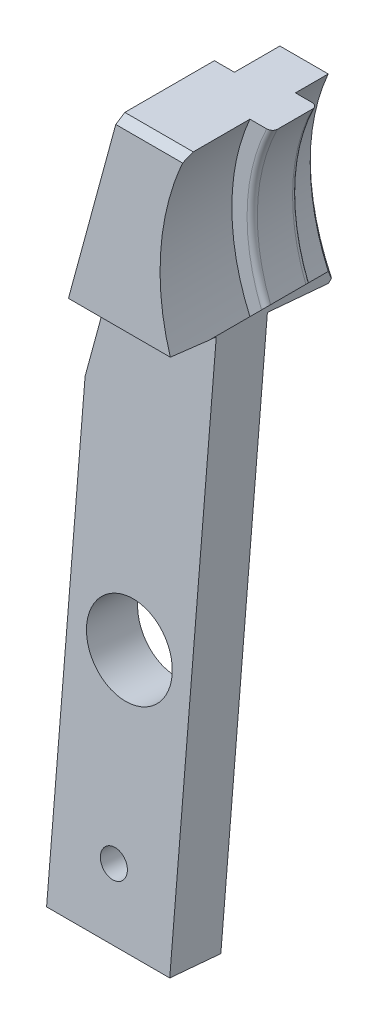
ISO-10303-21;
HEADER;
FILE_DESCRIPTION(('STEP AP214'),'2;1');
FILE_NAME('part.step','',(''),(''),'','','');
FILE_SCHEMA(('AUTOMOTIVE_DESIGN { 1 0 10303 214 1 1 1 1 }'));
ENDSEC;
DATA;
#1=APPLICATION_CONTEXT('core data for automotive mechanical design processes');
#2=APPLICATION_PROTOCOL_DEFINITION('international standard','automotive_design',2000,#1);
#3=PRODUCT_CONTEXT('',#1,'mechanical');
#4=PRODUCT('Part','Part','',(#3));
#5=PRODUCT_RELATED_PRODUCT_CATEGORY('part','',(#4));
#6=PRODUCT_DEFINITION_FORMATION('','',#4);
#7=PRODUCT_DEFINITION_CONTEXT('part definition',#1,'design');
#8=PRODUCT_DEFINITION('design','',#6,#7);
#9=PRODUCT_DEFINITION_SHAPE('','',#8);
#10=(LENGTH_UNIT() NAMED_UNIT(*) SI_UNIT(.MILLI.,.METRE.));
#11=(NAMED_UNIT(*) PLANE_ANGLE_UNIT() SI_UNIT($,.RADIAN.));
#12=(NAMED_UNIT(*) SI_UNIT($,.STERADIAN.) SOLID_ANGLE_UNIT());
#13=UNCERTAINTY_MEASURE_WITH_UNIT(LENGTH_MEASURE(1.E-05),#10,'distance_accuracy_value','');
#14=(GEOMETRIC_REPRESENTATION_CONTEXT(3) GLOBAL_UNCERTAINTY_ASSIGNED_CONTEXT((#13)) GLOBAL_UNIT_ASSIGNED_CONTEXT((#10,
#11,#12)) REPRESENTATION_CONTEXT('',''));
#15=CARTESIAN_POINT('',(0.,0.,0.));
#16=DIRECTION('',(0.,0.,1.));
#17=DIRECTION('',(1.,0.,0.));
#18=AXIS2_PLACEMENT_3D('',#15,#16,#17);
#19=CARTESIAN_POINT('',(-14.3693583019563,21.59,13.208));
#20=DIRECTION('',(-1.,0.,0.));
#21=DIRECTION('',(0.,1.,0.));
#22=AXIS2_PLACEMENT_3D('',#19,#20,#21);
#23=PLANE('',#22);
#24=DIRECTION('',(0.,0.0871557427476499,0.996194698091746));
#25=VECTOR('',#24,1.);
#26=CARTESIAN_POINT('',(-14.3693583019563,21.2109257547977,5.83884971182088));
#27=LINE('',#26,#25);
#28=CARTESIAN_POINT('',(-14.3693583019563,20.8136810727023,1.29832221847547));
#29=VERTEX_POINT('',#28);
#30=CARTESIAN_POINT('',(-14.3693583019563,21.2109257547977,5.83884971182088));
#31=VERTEX_POINT('',#30);
#32=EDGE_CURVE('E331',#29,#31,#27,.T.);
#33=ORIENTED_EDGE('',*,*,#32,.F.);
#34=DIRECTION('',(0.,0.707106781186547,-0.707106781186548));
#35=VECTOR('',#34,1.);
#36=CARTESIAN_POINT('',(-14.3693583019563,20.8136810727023,1.29832221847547));
#37=LINE('',#36,#35);
#38=CARTESIAN_POINT('',(-14.3693583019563,21.0270608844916,1.08494240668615));
#39=VERTEX_POINT('',#38);
#40=EDGE_CURVE('E381',#29,#39,#37,.T.);
#41=ORIENTED_EDGE('',*,*,#40,.T.);
#42=CARTESIAN_POINT('',(-14.3693583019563,21.0270608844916,1.08494240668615));
#43=CARTESIAN_POINT('',(-14.3693583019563,21.1203937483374,1.12542221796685));
#44=CARTESIAN_POINT('',(-14.3693583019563,21.2139717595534,1.16531691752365));
#45=CARTESIAN_POINT('',(-14.3693583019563,21.4016181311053,1.24393611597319));
#46=CARTESIAN_POINT('',(-14.3693583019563,21.4956864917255,1.28266061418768));
#47=CARTESIAN_POINT('',(-14.3693583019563,21.59,1.3208));
#48=B_SPLINE_CURVE_WITH_KNOTS('',3,(#42,#43,#44,#45,#46,#47),.UNSPECIFIED.,.F.,.F.,(4,2,4),(0.,
0.305181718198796,0.610363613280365),.UNSPECIFIED.);
#49=CARTESIAN_POINT('',(-14.3693583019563,21.59,1.32080000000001));
#50=VERTEX_POINT('',#49);
#51=EDGE_CURVE('E376',#39,#50,#48,.T.);
#52=ORIENTED_EDGE('',*,*,#51,.T.);
#53=DIRECTION('',(0.,0.,-1.));
#54=VECTOR('',#53,1.);
#55=CARTESIAN_POINT('',(-14.3693583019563,21.59,13.208));
#56=LINE('',#55,#54);
#57=CARTESIAN_POINT('',(-14.3693583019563,21.59,3.7592));
#58=VERTEX_POINT('',#57);
#59=EDGE_CURVE('E199',#58,#50,#56,.T.);
#60=ORIENTED_EDGE('',*,*,#59,.F.);
#61=DIRECTION('',(0.,0.,-1.));
#62=VECTOR('',#61,1.);
#63=CARTESIAN_POINT('',(-14.3693583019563,21.59,7.1374));
#64=LINE('',#63,#62);
#65=CARTESIAN_POINT('',(-14.3693583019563,21.59,7.1374));
#66=VERTEX_POINT('',#65);
#67=EDGE_CURVE('E178',#66,#58,#64,.T.);
#68=ORIENTED_EDGE('',*,*,#67,.F.);
#69=CARTESIAN_POINT('',(-14.3693583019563,21.59,10.1716881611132));
#70=VERTEX_POINT('',#69);
#71=EDGE_CURVE('E189',#70,#66,#56,.T.);
#72=ORIENTED_EDGE('',*,*,#71,.F.);
#73=DIRECTION('',(0.,0.0871557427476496,0.996194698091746));
#74=VECTOR('',#73,1.);
#75=CARTESIAN_POINT('',(-14.3693583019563,21.8324014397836,12.9423492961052));
#76=LINE('',#75,#74);
#77=CARTESIAN_POINT('',(-14.3693583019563,21.5429891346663,9.63435151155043));
#78=VERTEX_POINT('',#77);
#79=EDGE_CURVE('E322',#78,#70,#76,.T.);
#80=ORIENTED_EDGE('',*,*,#79,.F.);
#81=DIRECTION('',(0.,-0.996194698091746,0.0871557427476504));
#82=VECTOR('',#81,1.);
#83=CARTESIAN_POINT('',(-14.3693583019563,21.2793641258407,9.65741571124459));
#84=LINE('',#83,#82);
#85=CARTESIAN_POINT('',(-14.3693583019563,-17.9598028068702,13.0903979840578));
#86=VERTEX_POINT('',#85);
#87=EDGE_CURVE('E226',#78,#86,#84,.T.);
#88=ORIENTED_EDGE('',*,*,#87,.T.);
#89=DIRECTION('',(0.,0.087155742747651,0.996194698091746));
#90=VECTOR('',#89,1.);
#91=CARTESIAN_POINT('',(-14.3693583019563,-17.9598028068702,13.0903979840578));
#92=LINE('',#91,#90);
#93=CARTESIAN_POINT('',(-14.3693583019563,-18.2918661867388,9.29489618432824));
#94=VERTEX_POINT('',#93);
#95=EDGE_CURVE('E318',#94,#86,#92,.T.);
#96=ORIENTED_EDGE('',*,*,#95,.F.);
#97=DIRECTION('',(0.,0.996194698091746,-0.0871557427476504));
#98=VECTOR('',#97,1.);
#99=CARTESIAN_POINT('',(-14.3693583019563,20.9473007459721,5.86191391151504));
#100=LINE('',#99,#98);
#101=EDGE_CURVE('E232',#94,#31,#100,.T.);
#102=ORIENTED_EDGE('',*,*,#101,.T.);
#103=EDGE_LOOP('',(#33,#41,#52,#60,#68,#72,#80,#88,#96,#102));
#104=FACE_BOUND('',#103,.T.);
#105=ADVANCED_FACE('F33',(#104),#23,.F.);
#106=CARTESIAN_POINT('',(-23.5133583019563,14.732,13.208));
#107=DIRECTION('',(1.,0.,0.));
#108=DIRECTION('',(0.,-1.,0.));
#109=AXIS2_PLACEMENT_3D('',#106,#107,#108);
#110=PLANE('',#109);
#111=DIRECTION('',(0.,-0.087155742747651,-0.996194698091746));
#112=VECTOR('',#111,1.);
#113=CARTESIAN_POINT('',(-23.5133583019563,-17.9598028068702,13.0903979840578));
#114=LINE('',#113,#112);
#115=CARTESIAN_POINT('',(-23.5133583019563,-17.9598028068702,13.0903979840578));
#116=VERTEX_POINT('',#115);
#117=CARTESIAN_POINT('',(-23.5133583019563,-18.2918661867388,9.29489618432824));
#118=VERTEX_POINT('',#117);
#119=EDGE_CURVE('E304',#116,#118,#114,.T.);
#120=ORIENTED_EDGE('',*,*,#119,.F.);
#121=DIRECTION('',(0.,0.996194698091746,-0.0871557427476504));
#122=VECTOR('',#121,1.);
#123=CARTESIAN_POINT('',(-23.5133583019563,14.4734583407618,10.2528553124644));
#124=LINE('',#123,#122);
#125=CARTESIAN_POINT('',(-23.5133583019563,14.732,10.2302358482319));
#126=VERTEX_POINT('',#125);
#127=EDGE_CURVE('E224',#116,#126,#124,.T.);
#128=ORIENTED_EDGE('',*,*,#127,.T.);
#129=DIRECTION('',(0.,0.,-1.));
#130=VECTOR('',#129,1.);
#131=CARTESIAN_POINT('',(-23.5133583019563,14.732,13.208));
#132=LINE('',#131,#130);
#133=CARTESIAN_POINT('',(-23.5133583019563,14.732,6.40568226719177));
#134=VERTEX_POINT('',#133);
#135=EDGE_CURVE('E240',#126,#134,#132,.T.);
#136=ORIENTED_EDGE('',*,*,#135,.T.);
#137=DIRECTION('',(0.,-0.996194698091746,0.0871557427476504));
#138=VECTOR('',#137,1.);
#139=CARTESIAN_POINT('',(-23.5133583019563,14.1413949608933,6.45735351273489));
#140=LINE('',#139,#138);
#141=EDGE_CURVE('E229',#134,#118,#140,.T.);
#142=ORIENTED_EDGE('',*,*,#141,.T.);
#143=EDGE_LOOP('',(#120,#128,#136,#142));
#144=FACE_BOUND('',#143,.T.);
#145=ADVANCED_FACE('F386',(#144),#110,.F.);
#146=CARTESIAN_POINT('',(-29.464,18.5065876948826,9.90000221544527));
#147=DIRECTION('',(0.,0.0871557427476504,0.996194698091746));
#148=DIRECTION('',(0.,-0.996194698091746,0.0871557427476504));
#149=AXIS2_PLACEMENT_3D('',#146,#147,#148);
#150=PLANE('',#149);
#151=CARTESIAN_POINT('',(-18.9413583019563,-13.1016798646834,12.6653673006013));
#152=DIRECTION('',(0.,0.0871557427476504,0.996194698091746));
#153=DIRECTION('',(0.,-0.996194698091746,0.0871557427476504));
#154=AXIS2_PLACEMENT_3D('',#151,#152,#153);
#155=CIRCLE('',#154,1.);
#156=CARTESIAN_POINT('',(-18.9413583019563,-14.0978745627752,12.7525230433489));
#157=VERTEX_POINT('',#156);
#158=EDGE_CURVE('E471',#157,#157,#155,.T.);
#159=ORIENTED_EDGE('',*,*,#158,.F.);
#160=EDGE_LOOP('',(#159));
#161=FACE_BOUND('',#160,.T.);
#162=CARTESIAN_POINT('',(-18.9413583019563,0.0560597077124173,11.5142142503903));
#163=DIRECTION('',(0.,0.0871557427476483,0.996194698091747));
#164=DIRECTION('',(0.,-0.996194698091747,0.0871557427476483));
#165=AXIS2_PLACEMENT_3D('',#162,#163,#164);
#166=CIRCLE('',#165,3.175);
#167=CARTESIAN_POINT('',(-18.9413583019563,-3.10685845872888,11.7909337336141));
#168=VERTEX_POINT('',#167);
#169=EDGE_CURVE('E306',#168,#168,#166,.T.);
#170=ORIENTED_EDGE('',*,*,#169,.F.);
#171=EDGE_LOOP('',(#170));
#172=FACE_BOUND('',#171,.T.);
#173=ORIENTED_EDGE('',*,*,#127,.F.);
#174=DIRECTION('',(-1.,0.,0.));
#175=VECTOR('',#174,1.);
#176=CARTESIAN_POINT('',(-23.5133583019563,-17.9598028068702,13.0903979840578));
#177=LINE('',#176,#175);
#178=EDGE_CURVE('E320',#86,#116,#177,.T.);
#179=ORIENTED_EDGE('',*,*,#178,.F.);
#180=ORIENTED_EDGE('',*,*,#87,.F.);
#181=DIRECTION('',(1.,0.,0.));
#182=VECTOR('',#181,1.);
#183=CARTESIAN_POINT('',(-23.5133583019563,21.5429891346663,9.63435151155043));
#184=LINE('',#183,#182);
#185=CARTESIAN_POINT('',(-22.0980878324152,21.5429891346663,9.63435151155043));
#186=VERTEX_POINT('',#185);
#187=EDGE_CURVE('E324',#186,#78,#184,.T.);
#188=ORIENTED_EDGE('',*,*,#187,.F.);
#189=DIRECTION('',(0.202704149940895,0.975513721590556,-0.0853463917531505));
#190=VECTOR('',#189,1.);
#191=CARTESIAN_POINT('',(-19.5304760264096,33.8996209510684,8.55328630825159));
#192=LINE('',#191,#190);
#193=EDGE_CURVE('E222',#126,#186,#192,.T.);
#194=ORIENTED_EDGE('',*,*,#193,.F.);
#195=EDGE_LOOP('',(#173,#179,#180,#188,#194));
#196=FACE_BOUND('',#195,.T.);
#197=ADVANCED_FACE('F388',(#161,#172,#196),#150,.T.);
#198=CARTESIAN_POINT('',(-29.464,18.1745243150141,6.10450041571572));
#199=DIRECTION('',(0.,-0.0871557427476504,-0.996194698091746));
#200=DIRECTION('',(0.,0.996194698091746,-0.0871557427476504));
#201=AXIS2_PLACEMENT_3D('',#198,#199,#200);
#202=PLANE('',#201);
#203=CARTESIAN_POINT('',(-18.9413583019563,-13.433743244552,8.86986550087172));
#204=DIRECTION('',(0.,-0.0871557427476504,-0.996194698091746));
#205=DIRECTION('',(0.,0.996194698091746,-0.0871557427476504));
#206=AXIS2_PLACEMENT_3D('',#203,#204,#205);
#207=CIRCLE('',#206,0.999999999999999);
#208=CARTESIAN_POINT('',(-18.9413583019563,-12.4375485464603,8.78270975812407));
#209=VERTEX_POINT('',#208);
#210=EDGE_CURVE('E38',#209,#209,#207,.T.);
#211=ORIENTED_EDGE('',*,*,#210,.F.);
#212=EDGE_LOOP('',(#211));
#213=FACE_BOUND('',#212,.T.);
#214=CARTESIAN_POINT('',(-18.9413583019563,-0.276003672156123,7.71871245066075));
#215=DIRECTION('',(0.,-0.0871557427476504,-0.996194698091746));
#216=DIRECTION('',(0.,0.996194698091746,-0.0871557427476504));
#217=AXIS2_PLACEMENT_3D('',#214,#215,#216);
#218=CIRCLE('',#217,3.175);
#219=CARTESIAN_POINT('',(-18.9413583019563,2.88691449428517,7.44199296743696));
#220=VERTEX_POINT('',#219);
#221=EDGE_CURVE('E298',#220,#220,#218,.T.);
#222=ORIENTED_EDGE('',*,*,#221,.F.);
#223=EDGE_LOOP('',(#222));
#224=FACE_BOUND('',#223,.T.);
#225=ORIENTED_EDGE('',*,*,#101,.F.);
#226=DIRECTION('',(1.,0.,0.));
#227=VECTOR('',#226,1.);
#228=CARTESIAN_POINT('',(-23.5133583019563,-18.2918661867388,9.29489618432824));
#229=LINE('',#228,#227);
#230=EDGE_CURVE('E316',#118,#94,#229,.T.);
#231=ORIENTED_EDGE('',*,*,#230,.F.);
#232=ORIENTED_EDGE('',*,*,#141,.F.);
#233=DIRECTION('',(-0.202704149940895,-0.975513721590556,0.0853463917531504));
#234=VECTOR('',#233,1.);
#235=CARTESIAN_POINT('',(-19.5966410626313,33.5812017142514,4.75659080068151));
#236=LINE('',#235,#234);
#237=CARTESIAN_POINT('',(-19.4493583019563,34.29,4.6945789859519));
#238=VERTEX_POINT('',#237);
#239=EDGE_CURVE('E243',#238,#134,#236,.T.);
#240=ORIENTED_EDGE('',*,*,#239,.F.);
#241=DIRECTION('',(-1.,0.,0.));
#242=VECTOR('',#241,1.);
#243=CARTESIAN_POINT('',(-14.3693583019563,34.29,4.6945789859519));
#244=LINE('',#243,#242);
#245=CARTESIAN_POINT('',(-17.9605122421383,34.29,4.6945789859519));
#246=VERTEX_POINT('',#245);
#247=EDGE_CURVE('E342',#246,#238,#244,.T.);
#248=ORIENTED_EDGE('',*,*,#247,.F.);
#249=CARTESIAN_POINT('',(0.,27.94,5.25013199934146));
#250=DIRECTION('',(0.,0.0871557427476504,0.996194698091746));
#251=DIRECTION('',(0.,0.996194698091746,-0.0871557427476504));
#252=AXIS2_PLACEMENT_3D('',#249,#250,#251);
#253=ELLIPSE('',#252,19.1227679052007,19.05);
#254=CARTESIAN_POINT('',(-17.821954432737,21.2109257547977,5.83884971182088));
#255=VERTEX_POINT('',#254);
#256=EDGE_CURVE('E339',#255,#246,#253,.F.);
#257=ORIENTED_EDGE('',*,*,#256,.F.);
#258=DIRECTION('',(1.,0.,0.));
#259=VECTOR('',#258,1.);
#260=CARTESIAN_POINT('',(-23.5133583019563,21.2109257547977,5.83884971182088));
#261=LINE('',#260,#259);
#262=EDGE_CURVE('E333',#255,#31,#261,.T.);
#263=ORIENTED_EDGE('',*,*,#262,.T.);
#264=EDGE_LOOP('',(#225,#231,#232,#240,#248,#257,#263));
#265=FACE_BOUND('',#264,.T.);
#266=ADVANCED_FACE('F427',(#213,#224,#265),#202,.T.);
#267=CARTESIAN_POINT('',(-14.3693583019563,34.29,13.208));
#268=DIRECTION('',(0.,-1.,0.));
#269=DIRECTION('',(0.,0.,-1.));
#270=AXIS2_PLACEMENT_3D('',#267,#268,#269);
#271=PLANE('',#270);
#272=DIRECTION('',(0.,0.,-1.));
#273=VECTOR('',#272,1.);
#274=CARTESIAN_POINT('',(-14.3693583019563,34.29,13.208));
#275=LINE('',#274,#273);
#276=CARTESIAN_POINT('',(-14.3693583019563,34.29,3.7592));
#277=VERTEX_POINT('',#276);
#278=CARTESIAN_POINT('',(-14.3693583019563,34.29,1.32080000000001));
#279=VERTEX_POINT('',#278);
#280=EDGE_CURVE('E198',#277,#279,#275,.T.);
#281=ORIENTED_EDGE('',*,*,#280,.T.);
#282=DIRECTION('',(-1.,0.,0.));
#283=VECTOR('',#282,1.);
#284=CARTESIAN_POINT('',(-17.9605122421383,34.29,1.32080000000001));
#285=LINE('',#284,#283);
#286=CARTESIAN_POINT('',(-17.9605122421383,34.29,1.3208));
#287=VERTEX_POINT('',#286);
#288=EDGE_CURVE('E43',#279,#287,#285,.T.);
#289=ORIENTED_EDGE('',*,*,#288,.T.);
#290=DIRECTION('',(0.,0.,-1.));
#291=VECTOR('',#290,1.);
#292=CARTESIAN_POINT('',(-17.9605122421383,34.29,86.2048044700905));
#293=LINE('',#292,#291);
#294=EDGE_CURVE('E344',#287,#246,#293,.F.);
#295=ORIENTED_EDGE('',*,*,#294,.T.);
#296=ORIENTED_EDGE('',*,*,#247,.T.);
#297=DIRECTION('',(0.,0.,-1.));
#298=VECTOR('',#297,1.);
#299=CARTESIAN_POINT('',(-19.4493583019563,34.29,13.208));
#300=LINE('',#299,#298);
#301=CARTESIAN_POINT('',(-19.4493583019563,34.29,11.3444506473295));
#302=VERTEX_POINT('',#301);
#303=EDGE_CURVE('E237',#302,#238,#300,.T.);
#304=ORIENTED_EDGE('',*,*,#303,.F.);
#305=DIRECTION('',(-1.,0.,0.));
#306=VECTOR('',#305,1.);
#307=CARTESIAN_POINT('',(-19.4493583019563,34.29,11.3444506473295));
#308=LINE('',#307,#306);
#309=CARTESIAN_POINT('',(-14.3693583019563,34.29,11.3444506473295));
#310=VERTEX_POINT('',#309);
#311=EDGE_CURVE('E363',#310,#302,#308,.T.);
#312=ORIENTED_EDGE('',*,*,#311,.F.);
#313=CARTESIAN_POINT('',(-14.3693583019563,34.29,7.1374));
#314=VERTEX_POINT('',#313);
#315=EDGE_CURVE('E235',#310,#314,#275,.T.);
#316=ORIENTED_EDGE('',*,*,#315,.T.);
#317=DIRECTION('',(1.,0.,0.));
#318=VECTOR('',#317,1.);
#319=CARTESIAN_POINT('',(-14.3693583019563,34.29,7.1374));
#320=LINE('',#319,#318);
#321=CARTESIAN_POINT('',(-13.1241089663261,34.29,7.1374));
#322=VERTEX_POINT('',#321);
#323=EDGE_CURVE('E203',#314,#322,#320,.T.);
#324=ORIENTED_EDGE('',*,*,#323,.T.);
#325=CARTESIAN_POINT('',(-12.6995173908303,34.29,6.7564));
#326=CARTESIAN_POINT('',(-12.6994901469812,34.29,6.77622995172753));
#327=CARTESIAN_POINT('',(-12.7012463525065,34.29,6.79604103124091));
#328=CARTESIAN_POINT('',(-12.7081077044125,34.29,6.83500273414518));
#329=CARTESIAN_POINT('',(-12.7132005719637,34.29,6.85415550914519));
#330=CARTESIAN_POINT('',(-12.7265161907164,34.29,6.89132005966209));
#331=CARTESIAN_POINT('',(-12.7347370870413,34.29,6.90933250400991));
#332=CARTESIAN_POINT('',(-12.7539652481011,34.29,6.9438083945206));
#333=CARTESIAN_POINT('',(-12.7649743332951,34.29,6.9602708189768));
#334=CARTESIAN_POINT('',(-12.7899073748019,34.29,6.99197288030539));
#335=CARTESIAN_POINT('',(-12.8039359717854,34.29,7.00712995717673));
#336=CARTESIAN_POINT('',(-12.8341284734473,34.29,7.03513393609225));
#337=CARTESIAN_POINT('',(-12.850292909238,34.29,7.04798026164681));
#338=CARTESIAN_POINT('',(-12.8860127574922,34.29,7.07235683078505));
#339=CARTESIAN_POINT('',(-12.905745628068,34.29,7.08362688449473));
#340=CARTESIAN_POINT('',(-12.9467037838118,34.29,7.10303585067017));
#341=CARTESIAN_POINT('',(-12.967930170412,34.29,7.11117242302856));
#342=CARTESIAN_POINT('',(-13.0114247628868,34.29,7.12425054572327));
#343=CARTESIAN_POINT('',(-13.0336964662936,34.29,7.12918040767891));
#344=CARTESIAN_POINT('',(-13.0786838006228,34.29,7.13575461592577));
#345=CARTESIAN_POINT('',(-13.1013986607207,34.29,7.13740422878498));
#346=CARTESIAN_POINT('',(-13.1241089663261,34.29,7.1374));
#347=B_SPLINE_CURVE_WITH_KNOTS('',3,(#325,#326,#327,#328,#329,#330,#331,#332,#333,#334,#335,
#336,#337,#338,#339,#340,#341,#342,#343,#344,#345,#346),.UNSPECIFIED.,.F.,.F.,(4,2,2,2,2,2,2,2,
2,2,4),(0.,0.0593827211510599,0.118548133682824,0.177678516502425,0.236847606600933,
0.298550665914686,0.360269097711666,0.428161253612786,0.496104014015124,0.564293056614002,
0.632372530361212),.UNSPECIFIED.);
#348=CARTESIAN_POINT('',(-12.6995173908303,34.29,6.7564));
#349=VERTEX_POINT('',#348);
#350=EDGE_CURVE('E252',#349,#322,#347,.T.);
#351=ORIENTED_EDGE('',*,*,#350,.F.);
#352=DIRECTION('',(0.,0.,-1.));
#353=VECTOR('',#352,1.);
#354=CARTESIAN_POINT('',(-12.6995173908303,34.29,7.1374));
#355=LINE('',#354,#353);
#356=CARTESIAN_POINT('',(-12.6995173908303,34.29,4.1402));
#357=VERTEX_POINT('',#356);
#358=EDGE_CURVE('E210',#349,#357,#355,.T.);
#359=ORIENTED_EDGE('',*,*,#358,.T.);
#360=CARTESIAN_POINT('',(-13.1241089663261,34.29,3.7592));
#361=CARTESIAN_POINT('',(-13.098138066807,34.29,3.75919255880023));
#362=CARTESIAN_POINT('',(-13.072158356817,34.29,3.76135190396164));
#363=CARTESIAN_POINT('',(-13.0208454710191,34.29,3.76995224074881));
#364=CARTESIAN_POINT('',(-12.9955142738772,34.29,3.77640501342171));
#365=CARTESIAN_POINT('',(-12.9462773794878,34.29,3.79355233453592));
#366=CARTESIAN_POINT('',(-12.922373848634,34.29,3.80425314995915));
#367=CARTESIAN_POINT('',(-12.8768695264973,34.29,3.82974044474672));
#368=CARTESIAN_POINT('',(-12.8552662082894,34.29,3.84452237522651));
#369=CARTESIAN_POINT('',(-12.8163667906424,34.29,3.87694868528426));
#370=CARTESIAN_POINT('',(-12.7988953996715,34.29,3.89438195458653));
#371=CARTESIAN_POINT('',(-12.7675557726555,34.29,3.9322530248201));
#372=CARTESIAN_POINT('',(-12.7536863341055,34.29,3.95268981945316));
#373=CARTESIAN_POINT('',(-12.7315803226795,34.29,3.99359045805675));
#374=CARTESIAN_POINT('',(-12.7228976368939,34.29,4.01381378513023));
#375=CARTESIAN_POINT('',(-12.7094712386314,34.29,4.05550705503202));
#376=CARTESIAN_POINT('',(-12.7047181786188,34.29,4.07697390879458));
#377=CARTESIAN_POINT('',(-12.7012103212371,34.29,4.10555694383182));
#378=CARTESIAN_POINT('',(-12.7005754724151,34.29,4.11247549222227));
#379=CARTESIAN_POINT('',(-12.6997296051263,34.29,4.12632817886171));
#380=CARTESIAN_POINT('',(-12.6995179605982,34.29,4.13326227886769));
#381=CARTESIAN_POINT('',(-12.6995173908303,34.29,4.1402));
#382=B_SPLINE_CURVE_WITH_KNOTS('',3,(#360,#361,#362,#363,#364,#365,#366,#367,#368,#369,#370,
#371,#372,#373,#374,#375,#376,#377,#378,#379,#380,#381),.UNSPECIFIED.,.F.,.F.,(4,2,2,2,2,2,2,2,
2,2,4),(0.,0.0778391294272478,0.155892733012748,0.234061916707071,0.312144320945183,
0.385777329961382,0.459385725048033,0.525057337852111,0.590572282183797,0.611405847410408,
0.632208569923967),.UNSPECIFIED.);
#383=CARTESIAN_POINT('',(-13.1241089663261,34.29,3.7592));
#384=VERTEX_POINT('',#383);
#385=EDGE_CURVE('E260',#384,#357,#382,.T.);
#386=ORIENTED_EDGE('',*,*,#385,.F.);
#387=DIRECTION('',(1.,0.,0.));
#388=VECTOR('',#387,1.);
#389=CARTESIAN_POINT('',(-14.3693583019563,34.29,3.7592));
#390=LINE('',#389,#388);
#391=EDGE_CURVE('E205',#277,#384,#390,.T.);
#392=ORIENTED_EDGE('',*,*,#391,.F.);
#393=EDGE_LOOP('',(#281,#289,#295,#296,#304,#312,#316,#324,#351,#359,#386,#392));
#394=FACE_BOUND('',#393,.T.);
#395=ADVANCED_FACE('F266',(#394),#271,.F.);
#396=CARTESIAN_POINT('',(0.,27.94,13.208));
#397=DIRECTION('',(0.,0.,-1.));
#398=DIRECTION('',(1.,0.,0.));
#399=AXIS2_PLACEMENT_3D('',#396,#397,#398);
#400=CYLINDRICAL_SURFACE('',#399,15.7099);
#401=ORIENTED_EDGE('',*,*,#59,.T.);
#402=CARTESIAN_POINT('',(0.,27.94,1.32080000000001));
#403=DIRECTION('',(0.,0.,-1.));
#404=DIRECTION('',(-1.,0.,0.));
#405=AXIS2_PLACEMENT_3D('',#402,#403,#404);
#406=CIRCLE('',#405,15.7099);
#407=EDGE_CURVE('E12',#50,#279,#406,.T.);
#408=ORIENTED_EDGE('',*,*,#407,.T.);
#409=ORIENTED_EDGE('',*,*,#280,.F.);
#410=CARTESIAN_POINT('',(0.,27.94,3.7592));
#411=DIRECTION('',(0.,0.,-1.));
#412=DIRECTION('',(-1.,0.,0.));
#413=AXIS2_PLACEMENT_3D('',#410,#411,#412);
#414=CIRCLE('',#413,15.7099);
#415=EDGE_CURVE('E345',#58,#277,#414,.T.);
#416=ORIENTED_EDGE('',*,*,#415,.F.);
#417=EDGE_LOOP('',(#401,#408,#409,#416));
#418=FACE_BOUND('',#417,.T.);
#419=ADVANCED_FACE('F399',(#418),#400,.F.);
#420=CARTESIAN_POINT('',(0.,27.94,86.2048044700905));
#421=DIRECTION('',(0.,0.,-1.));
#422=DIRECTION('',(1.,0.,0.));
#423=AXIS2_PLACEMENT_3D('',#420,#421,#422);
#424=CYLINDRICAL_SURFACE('',#423,19.05);
#425=CARTESIAN_POINT('',(0.,27.94,1.0414));
#426=DIRECTION('',(0.,0.,-1.));
#427=DIRECTION('',(-1.,0.,0.));
#428=AXIS2_PLACEMENT_3D('',#425,#426,#427);
#429=CIRCLE('',#428,19.05);
#430=CARTESIAN_POINT('',(-18.0568633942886,34.0106,1.0414));
#431=VERTEX_POINT('',#430);
#432=CARTESIAN_POINT('',(-17.7683395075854,21.0706032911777,1.0414));
#433=VERTEX_POINT('',#432);
#434=EDGE_CURVE('E368',#431,#433,#429,.F.);
#435=ORIENTED_EDGE('',*,*,#434,.T.);
#436=CARTESIAN_POINT('',(0.,27.94,-5.82799670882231));
#437=DIRECTION('',(0.,-0.707106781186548,-0.707106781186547));
#438=DIRECTION('',(0.,0.707106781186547,-0.707106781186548));
#439=AXIS2_PLACEMENT_3D('',#436,#437,#438);
#440=ELLIPSE('',#439,26.9407683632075,19.05);
#441=CARTESIAN_POINT('',(-17.666863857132,20.8136810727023,1.29832221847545));
#442=VERTEX_POINT('',#441);
#443=EDGE_CURVE('E634',#433,#442,#440,.F.);
#444=ORIENTED_EDGE('',*,*,#443,.T.);
#445=CARTESIAN_POINT('',(0.,27.94,82.7525202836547));
#446=DIRECTION('',(0.,0.996194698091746,-0.0871557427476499));
#447=DIRECTION('',(0.,-0.0871557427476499,-0.996194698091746));
#448=AXIS2_PLACEMENT_3D('',#445,#446,#447);
#449=ELLIPSE('',#448,218.574237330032,19.05);
#450=EDGE_CURVE('E336',#255,#442,#449,.F.);
#451=ORIENTED_EDGE('',*,*,#450,.F.);
#452=ORIENTED_EDGE('',*,*,#256,.T.);
#453=ORIENTED_EDGE('',*,*,#294,.F.);
#454=CARTESIAN_POINT('',(0.,27.94,-5.02920000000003));
#455=DIRECTION('',(0.,0.707106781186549,-0.707106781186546));
#456=DIRECTION('',(0.,-0.707106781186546,-0.707106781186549));
#457=AXIS2_PLACEMENT_3D('',#454,#455,#456);
#458=ELLIPSE('',#457,26.9407683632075,19.05);
#459=EDGE_CURVE('E632',#287,#431,#458,.F.);
#460=ORIENTED_EDGE('',*,*,#459,.T.);
#461=EDGE_LOOP('',(#435,#444,#451,#452,#453,#460));
#462=FACE_BOUND('',#461,.T.);
#463=ADVANCED_FACE('F392',(#462),#424,.T.);
#464=CARTESIAN_POINT('',(-19.4493583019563,34.29,13.208));
#465=DIRECTION('',(0.97908607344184,-0.203446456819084,0.));
#466=DIRECTION('',(-0.203446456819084,-0.97908607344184,0.));
#467=AXIS2_PLACEMENT_3D('',#464,#465,#466);
#468=PLANE('',#467);
#469=ORIENTED_EDGE('',*,*,#193,.T.);
#470=DIRECTION('',(0.0181073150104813,0.0871414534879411,0.996031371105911));
#471=VECTOR('',#470,1.);
#472=CARTESIAN_POINT('',(-22.0126535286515,21.9541417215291,14.333847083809));
#473=LINE('',#472,#471);
#474=CARTESIAN_POINT('',(-22.0379502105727,21.8324014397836,12.9423492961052));
#475=VERTEX_POINT('',#474);
#476=EDGE_CURVE('E328',#186,#475,#473,.T.);
#477=ORIENTED_EDGE('',*,*,#476,.T.);
#478=DIRECTION('',(0.202704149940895,0.975513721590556,-0.0853463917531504));
#479=VECTOR('',#478,1.);
#480=CARTESIAN_POINT('',(-19.4728093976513,34.1771416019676,11.862324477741));
#481=LINE('',#480,#479);
#482=CARTESIAN_POINT('',(-19.5650373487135,33.7332945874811,11.9011560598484));
#483=VERTEX_POINT('',#482);
#484=EDGE_CURVE('E220',#475,#483,#481,.T.);
#485=ORIENTED_EDGE('',*,*,#484,.T.);
#486=DIRECTION('',(-0.145370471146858,-0.699595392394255,0.699595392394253));
#487=VECTOR('',#486,1.);
#488=CARTESIAN_POINT('',(-19.6484755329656,33.3317483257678,12.3027023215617));
#489=LINE('',#488,#487);
#490=EDGE_CURVE('E365',#302,#483,#489,.T.);
#491=ORIENTED_EDGE('',*,*,#490,.F.);
#492=ORIENTED_EDGE('',*,*,#303,.T.);
#493=ORIENTED_EDGE('',*,*,#239,.T.);
#494=ORIENTED_EDGE('',*,*,#135,.F.);
#495=EDGE_LOOP('',(#469,#477,#485,#491,#492,#493,#494));
#496=FACE_BOUND('',#495,.T.);
#497=ADVANCED_FACE('F390',(#496),#468,.F.);
#498=CARTESIAN_POINT('',(0.,27.94,12.408003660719));
#499=DIRECTION('',(0.,-0.0871557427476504,-0.996194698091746));
#500=DIRECTION('',(0.,0.996194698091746,-0.0871557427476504));
#501=AXIS2_PLACEMENT_3D('',#498,#499,#500);
#502=ELLIPSE('',#501,15.7699092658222,15.7099);
#503=CARTESIAN_POINT('',(-14.602694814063,33.7332945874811,11.9011560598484));
#504=VERTEX_POINT('',#503);
#505=CARTESIAN_POINT('',(-14.4740525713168,21.8324014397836,12.9423492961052));
#506=VERTEX_POINT('',#505);
#507=EDGE_CURVE('E213',#504,#506,#502,.F.);
#508=ORIENTED_EDGE('',*,*,#507,.T.);
#509=CARTESIAN_POINT('',(0.,27.94,82.7525202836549));
#510=DIRECTION('',(0.,0.996194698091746,-0.0871557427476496));
#511=DIRECTION('',(0.,-0.0871557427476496,-0.996194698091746));
#512=AXIS2_PLACEMENT_3D('',#509,#510,#511);
#513=ELLIPSE('',#512,180.250887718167,15.7099);
#514=EDGE_CURVE('E195',#506,#70,#513,.F.);
#515=ORIENTED_EDGE('',*,*,#514,.T.);
#516=ORIENTED_EDGE('',*,*,#71,.T.);
#517=CARTESIAN_POINT('',(0.,27.94,7.1374));
#518=DIRECTION('',(0.,0.,-1.));
#519=DIRECTION('',(-1.,0.,0.));
#520=AXIS2_PLACEMENT_3D('',#517,#518,#519);
#521=CIRCLE('',#520,15.7099);
#522=EDGE_CURVE('E193',#66,#314,#521,.T.);
#523=ORIENTED_EDGE('',*,*,#522,.T.);
#524=ORIENTED_EDGE('',*,*,#315,.F.);
#525=CARTESIAN_POINT('',(0.,27.94,17.6944506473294));
#526=DIRECTION('',(0.,-0.707106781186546,-0.707106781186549));
#527=DIRECTION('',(0.,0.707106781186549,-0.707106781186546));
#528=AXIS2_PLACEMENT_3D('',#525,#526,#527);
#529=ELLIPSE('',#528,22.2171536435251,15.7099);
#530=EDGE_CURVE('E359',#504,#310,#529,.T.);
#531=ORIENTED_EDGE('',*,*,#530,.F.);
#532=EDGE_LOOP('',(#508,#515,#516,#523,#524,#531));
#533=FACE_BOUND('',#532,.T.);
#534=ADVANCED_FACE('F191',(#533),#400,.F.);
#535=CARTESIAN_POINT('',(-23.5133583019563,18.796,13.208));
#536=DIRECTION('',(0.,0.0871557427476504,0.996194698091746));
#537=DIRECTION('',(0.,-0.996194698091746,0.0871557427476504));
#538=AXIS2_PLACEMENT_3D('',#535,#536,#537);
#539=PLANE('',#538);
#540=DIRECTION('',(-1.,0.,0.));
#541=VECTOR('',#540,1.);
#542=CARTESIAN_POINT('',(-23.5133583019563,21.8324014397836,12.9423492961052));
#543=LINE('',#542,#541);
#544=EDGE_CURVE('E371',#506,#475,#543,.T.);
#545=ORIENTED_EDGE('',*,*,#544,.F.);
#546=ORIENTED_EDGE('',*,*,#507,.F.);
#547=DIRECTION('',(1.,0.,0.));
#548=VECTOR('',#547,1.);
#549=CARTESIAN_POINT('',(-14.3693583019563,33.7332945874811,11.9011560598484));
#550=LINE('',#549,#548);
#551=EDGE_CURVE('E358',#483,#504,#550,.T.);
#552=ORIENTED_EDGE('',*,*,#551,.F.);
#553=ORIENTED_EDGE('',*,*,#484,.F.);
#554=EDGE_LOOP('',(#545,#546,#552,#553));
#555=FACE_BOUND('',#554,.T.);
#556=ADVANCED_FACE('F398',(#555),#539,.T.);
#557=CARTESIAN_POINT('',(0.,27.94,7.1374));
#558=DIRECTION('',(0.,0.,-1.));
#559=DIRECTION('',(1.,0.,0.));
#560=AXIS2_PLACEMENT_3D('',#557,#558,#559);
#561=CYLINDRICAL_SURFACE('',#560,14.1986);
#562=CARTESIAN_POINT('',(0.,27.94,6.7564));
#563=DIRECTION('',(0.,0.,-1.));
#564=DIRECTION('',(-1.,0.,0.));
#565=AXIS2_PLACEMENT_3D('',#562,#563,#564);
#566=CIRCLE('',#565,14.1986);
#567=CARTESIAN_POINT('',(-13.2141668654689,22.7451914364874,6.7564));
#568=VERTEX_POINT('',#567);
#569=EDGE_CURVE('E245',#568,#349,#566,.T.);
#570=ORIENTED_EDGE('',*,*,#569,.F.);
#571=DIRECTION('',(0.,0.,-1.));
#572=VECTOR('',#571,1.);
#573=CARTESIAN_POINT('',(-13.2141668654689,22.7451914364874,7.1374));
#574=LINE('',#573,#572);
#575=CARTESIAN_POINT('',(-13.2141668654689,22.7451914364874,4.1402));
#576=VERTEX_POINT('',#575);
#577=EDGE_CURVE('E51',#576,#568,#574,.F.);
#578=ORIENTED_EDGE('',*,*,#577,.F.);
#579=CARTESIAN_POINT('',(0.,27.94,4.1402));
#580=DIRECTION('',(0.,0.,-1.));
#581=DIRECTION('',(-1.,0.,0.));
#582=AXIS2_PLACEMENT_3D('',#579,#580,#581);
#583=CIRCLE('',#582,14.1986);
#584=EDGE_CURVE('E247',#357,#576,#583,.F.);
#585=ORIENTED_EDGE('',*,*,#584,.F.);
#586=ORIENTED_EDGE('',*,*,#358,.F.);
#587=EDGE_LOOP('',(#570,#578,#585,#586));
#588=FACE_BOUND('',#587,.T.);
#589=ADVANCED_FACE('F451',(#588),#561,.F.);
#590=CARTESIAN_POINT('',(0.,27.94,7.1374));
#591=DIRECTION('',(0.,0.,1.));
#592=DIRECTION('',(-1.,0.,0.));
#593=AXIS2_PLACEMENT_3D('',#590,#591,#592);
#594=PLANE('',#593);
#595=DIRECTION('',(-0.707106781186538,-0.707106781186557,0.));
#596=VECTOR('',#595,1.);
#597=CARTESIAN_POINT('',(-14.3693583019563,21.59,7.1374));
#598=LINE('',#597,#596);
#599=CARTESIAN_POINT('',(-13.5073020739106,22.4520562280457,7.1374));
#600=VERTEX_POINT('',#599);
#601=EDGE_CURVE('E174',#600,#66,#598,.T.);
#602=ORIENTED_EDGE('',*,*,#601,.F.);
#603=CARTESIAN_POINT('',(0.,27.94,7.1374));
#604=DIRECTION('',(0.,0.,-1.));
#605=DIRECTION('',(-1.,0.,0.));
#606=AXIS2_PLACEMENT_3D('',#603,#604,#605);
#607=CIRCLE('',#606,14.5796);
#608=EDGE_CURVE('E357',#322,#600,#607,.F.);
#609=ORIENTED_EDGE('',*,*,#608,.F.);
#610=ORIENTED_EDGE('',*,*,#323,.F.);
#611=ORIENTED_EDGE('',*,*,#522,.F.);
#612=EDGE_LOOP('',(#602,#609,#610,#611));
#613=FACE_BOUND('',#612,.T.);
#614=ADVANCED_FACE('F201',(#613),#594,.T.);
#615=CARTESIAN_POINT('',(0.,27.94,3.7592));
#616=DIRECTION('',(0.,0.,1.));
#617=DIRECTION('',(-1.,0.,0.));
#618=AXIS2_PLACEMENT_3D('',#615,#616,#617);
#619=PLANE('',#618);
#620=CARTESIAN_POINT('',(0.,27.94,3.7592));
#621=DIRECTION('',(0.,0.,-1.));
#622=DIRECTION('',(-1.,0.,0.));
#623=AXIS2_PLACEMENT_3D('',#620,#621,#622);
#624=CIRCLE('',#623,14.5796);
#625=CARTESIAN_POINT('',(-13.5073020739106,22.4520562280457,3.7592));
#626=VERTEX_POINT('',#625);
#627=EDGE_CURVE('E250',#626,#384,#624,.T.);
#628=ORIENTED_EDGE('',*,*,#627,.F.);
#629=DIRECTION('',(0.707106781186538,0.707106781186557,0.));
#630=VECTOR('',#629,1.);
#631=CARTESIAN_POINT('',(-14.3693583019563,21.59,3.7592));
#632=LINE('',#631,#630);
#633=EDGE_CURVE('E184',#58,#626,#632,.T.);
#634=ORIENTED_EDGE('',*,*,#633,.F.);
#635=ORIENTED_EDGE('',*,*,#415,.T.);
#636=ORIENTED_EDGE('',*,*,#391,.T.);
#637=EDGE_LOOP('',(#628,#634,#635,#636));
#638=FACE_BOUND('',#637,.T.);
#639=ADVANCED_FACE('F351',(#638),#619,.F.);
#640=CARTESIAN_POINT('',(0.,27.94,4.1402));
#641=DIRECTION('',(0.,0.,1.));
#642=DIRECTION('',(-1.,0.,0.));
#643=AXIS2_PLACEMENT_3D('',#640,#641,#642);
#644=TOROIDAL_SURFACE('',#643,14.5796,0.381);
#645=CARTESIAN_POINT('',(-13.2149906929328,22.7443676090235,4.16870917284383));
#646=CARTESIAN_POINT('',(-13.2138196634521,22.7455386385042,4.14879138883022));
#647=CARTESIAN_POINT('',(-13.2138914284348,22.7454668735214,4.12874127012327));
#648=CARTESIAN_POINT('',(-13.2164326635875,22.7429256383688,4.08899937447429));
#649=CARTESIAN_POINT('',(-13.2188957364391,22.7404625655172,4.06930678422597));
#650=CARTESIAN_POINT('',(-13.226126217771,22.7332320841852,4.03079143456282));
#651=CARTESIAN_POINT('',(-13.2308935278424,22.7284647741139,4.01196863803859));
#652=CARTESIAN_POINT('',(-13.2425371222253,22.716821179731,3.97567689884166));
#653=CARTESIAN_POINT('',(-13.2494140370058,22.7099442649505,3.95820836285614));
#654=CARTESIAN_POINT('',(-13.2652382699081,22.6941200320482,3.92458884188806));
#655=CARTESIAN_POINT('',(-13.2742357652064,22.6851225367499,3.90848522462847));
#656=CARTESIAN_POINT('',(-13.293893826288,22.6654644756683,3.87845727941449));
#657=CARTESIAN_POINT('',(-13.3045549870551,22.6548033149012,3.86453373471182));
#658=CARTESIAN_POINT('',(-13.3280738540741,22.6312844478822,3.83816017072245));
#659=CARTESIAN_POINT('',(-13.3410358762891,22.6183224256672,3.82589631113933));
#660=CARTESIAN_POINT('',(-13.3681450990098,22.5912132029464,3.80435765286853));
#661=CARTESIAN_POINT('',(-13.3822926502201,22.5770656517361,3.79508374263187));
#662=CARTESIAN_POINT('',(-13.4125658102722,22.5467924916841,3.77904129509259));
#663=CARTESIAN_POINT('',(-13.4287593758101,22.5305989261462,3.77252879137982));
#664=CARTESIAN_POINT('',(-13.4616740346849,22.4976842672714,3.76322498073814));
#665=CARTESIAN_POINT('',(-13.4783953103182,22.480962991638,3.76043497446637));
#666=CARTESIAN_POINT('',(-13.5128255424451,22.4465327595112,3.75857331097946));
#667=CARTESIAN_POINT('',(-13.5305401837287,22.4288181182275,3.75970497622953));
#668=CARTESIAN_POINT('',(-13.565589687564,22.3937686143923,3.7661390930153));
#669=CARTESIAN_POINT('',(-13.5829245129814,22.3764337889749,3.77144195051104));
#670=CARTESIAN_POINT('',(-13.6167577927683,22.3426005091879,3.78617562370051));
#671=CARTESIAN_POINT('',(-13.6332534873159,22.3261048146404,3.79561918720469));
#672=CARTESIAN_POINT('',(-13.6648097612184,22.2945485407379,3.81848450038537));
#673=CARTESIAN_POINT('',(-13.679870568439,22.2794877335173,3.83190561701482));
#674=CARTESIAN_POINT('',(-13.7073032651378,22.2520550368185,3.86169253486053));
#675=CARTESIAN_POINT('',(-13.7197707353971,22.2395875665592,3.87788187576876));
#676=CARTESIAN_POINT('',(-13.742404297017,22.2169540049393,3.91321166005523));
#677=CARTESIAN_POINT('',(-13.7525717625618,22.2067865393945,3.93235032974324));
#678=CARTESIAN_POINT('',(-13.769465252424,22.1898930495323,3.97142830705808));
#679=CARTESIAN_POINT('',(-13.7763974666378,22.1829608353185,3.99118950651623));
#680=CARTESIAN_POINT('',(-13.7876154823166,22.1717428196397,4.03215724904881));
#681=CARTESIAN_POINT('',(-13.7919036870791,22.1674546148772,4.05336246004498));
#682=CARTESIAN_POINT('',(-13.7968211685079,22.1625371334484,4.09036532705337));
#683=CARTESIAN_POINT('',(-13.7981442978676,22.1612140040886,4.10598520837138));
#684=CARTESIAN_POINT('',(-13.7993135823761,22.1600447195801,4.13733200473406));
#685=CARTESIAN_POINT('',(-13.7991600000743,22.160198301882,4.15305890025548));
#686=CARTESIAN_POINT('',(-13.7982577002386,22.1611006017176,4.1687091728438));
#687=B_SPLINE_CURVE_WITH_KNOTS('',3,(#645,#646,#647,#648,#649,#650,#651,#652,#653,#654,#655,
#656,#657,#658,#659,#660,#661,#662,#663,#664,#665,#666,#667,#668,#669,#670,#671,#672,#673,#674,
#675,#676,#677,#678,#679,#680,#681,#682,#683,#684,#685,#686),.UNSPECIFIED.,.F.,.F.,(4,2,2,2,2,2,
2,2,2,2,2,2,2,2,2,2,2,2,2,2,4),(0.,0.0598658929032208,0.119572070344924,0.179275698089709,
0.238997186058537,0.300306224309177,0.361637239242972,0.427521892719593,0.493426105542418,
0.564540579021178,0.635679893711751,0.710561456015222,0.785450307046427,0.86057135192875,
0.935680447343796,1.00711013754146,1.07849703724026,1.14433050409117,1.21010404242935,
1.25716630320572,1.30422019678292),.UNSPECIFIED.);
#688=EDGE_CURVE('E472',#576,#626,#687,.T.);
#689=ORIENTED_EDGE('',*,*,#688,.T.);
#690=ORIENTED_EDGE('',*,*,#627,.T.);
#691=ORIENTED_EDGE('',*,*,#385,.T.);
#692=ORIENTED_EDGE('',*,*,#584,.T.);
#693=EDGE_LOOP('',(#689,#690,#691,#692));
#694=FACE_BOUND('',#693,.T.);
#695=ADVANCED_FACE('F275',(#694),#644,.T.);
#696=CARTESIAN_POINT('',(0.,27.94,6.7564));
#697=DIRECTION('',(0.,0.,1.));
#698=DIRECTION('',(-1.,0.,0.));
#699=AXIS2_PLACEMENT_3D('',#696,#697,#698);
#700=TOROIDAL_SURFACE('',#699,14.5796,0.381);
#701=CARTESIAN_POINT('',(-13.7982577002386,22.1611006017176,6.7278908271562));
#702=CARTESIAN_POINT('',(-13.7994250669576,22.1599332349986,6.74794507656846));
#703=CARTESIAN_POINT('',(-13.7993457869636,22.1600125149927,6.76813164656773));
#704=CARTESIAN_POINT('',(-13.7967779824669,22.1625803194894,6.80814859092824));
#705=CARTESIAN_POINT('',(-13.7942952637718,22.1650630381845,6.82797970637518));
#706=CARTESIAN_POINT('',(-13.7870093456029,22.1723489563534,6.8667676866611));
#707=CARTESIAN_POINT('',(-13.7822060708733,22.177152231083,6.88572452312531));
#708=CARTESIAN_POINT('',(-13.7704684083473,22.188889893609,6.92226771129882));
#709=CARTESIAN_POINT('',(-13.7635335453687,22.1958247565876,6.93985375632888));
#710=CARTESIAN_POINT('',(-13.7475920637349,22.2117662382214,6.97362554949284));
#711=CARTESIAN_POINT('',(-13.7385410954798,22.2208172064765,6.9897693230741));
#712=CARTESIAN_POINT('',(-13.7187594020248,22.2405988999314,7.01984589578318));
#713=CARTESIAN_POINT('',(-13.7080281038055,22.2513301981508,7.03377793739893));
#714=CARTESIAN_POINT('',(-13.684443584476,22.2749147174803,7.06001991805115));
#715=CARTESIAN_POINT('',(-13.6714970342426,22.2878612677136,7.0721619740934));
#716=CARTESIAN_POINT('',(-13.6444274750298,22.3149308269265,7.09344740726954));
#717=CARTESIAN_POINT('',(-13.6303041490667,22.3290541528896,7.10258997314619));
#718=CARTESIAN_POINT('',(-13.6001579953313,22.359200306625,7.11831959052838));
#719=CARTESIAN_POINT('',(-13.5840720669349,22.3752862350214,7.12466505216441));
#720=CARTESIAN_POINT('',(-13.5513913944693,22.407966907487,7.13367204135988));
#721=CARTESIAN_POINT('',(-13.5347964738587,22.4245618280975,7.13633227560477));
#722=CARTESIAN_POINT('',(-13.5005869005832,22.4587714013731,7.13798752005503));
#723=CARTESIAN_POINT('',(-13.4829669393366,22.4763913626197,7.13677010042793));
#724=CARTESIAN_POINT('',(-13.4481101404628,22.5112481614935,7.13022426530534));
#725=CARTESIAN_POINT('',(-13.4308733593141,22.5284849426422,7.12489524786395));
#726=CARTESIAN_POINT('',(-13.3970830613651,22.5622752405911,7.1101219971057));
#727=CARTESIAN_POINT('',(-13.3805396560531,22.5788186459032,7.10063123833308));
#728=CARTESIAN_POINT('',(-13.3488833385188,22.6104749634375,7.07768372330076));
#729=CARTESIAN_POINT('',(-13.3337702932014,22.6255880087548,7.06422733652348));
#730=CARTESIAN_POINT('',(-13.3061523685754,22.6532059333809,7.03429289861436));
#731=CARTESIAN_POINT('',(-13.2935625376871,22.6657957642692,7.01797205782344));
#732=CARTESIAN_POINT('',(-13.2707134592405,22.6886448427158,6.98233822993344));
#733=CARTESIAN_POINT('',(-13.2604527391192,22.6989055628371,6.96302714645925));
#734=CARTESIAN_POINT('',(-13.2434632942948,22.7158950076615,6.92365453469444));
#735=CARTESIAN_POINT('',(-13.2365147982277,22.7228435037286,6.90378257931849));
#736=CARTESIAN_POINT('',(-13.2253073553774,22.7340509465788,6.86258050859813));
#737=CARTESIAN_POINT('',(-13.2210455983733,22.738312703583,6.84125194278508));
#738=CARTESIAN_POINT('',(-13.2162753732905,22.7430829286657,6.80446647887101));
#739=CARTESIAN_POINT('',(-13.2150197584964,22.7443385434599,6.78919570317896));
#740=CARTESIAN_POINT('',(-13.2139325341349,22.7454257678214,6.75855550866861));
#741=CARTESIAN_POINT('',(-13.2141007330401,22.7452575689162,6.74318610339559));
#742=CARTESIAN_POINT('',(-13.2149906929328,22.7443676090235,6.72789082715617));
#743=B_SPLINE_CURVE_WITH_KNOTS('',3,(#701,#702,#703,#704,#705,#706,#707,#708,#709,#710,#711,
#712,#713,#714,#715,#716,#717,#718,#719,#720,#721,#722,#723,#724,#725,#726,#727,#728,#729,#730,
#731,#732,#733,#734,#735,#736,#737,#738,#739,#740,#741,#742),.UNSPECIFIED.,.F.,.F.,(4,2,2,2,2,2,
2,2,2,2,2,2,2,2,2,2,2,2,2,2,4),(0.,0.0602740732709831,0.120402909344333,0.180533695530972,
0.240677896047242,0.302218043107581,0.363779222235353,0.429405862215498,0.495050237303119,
0.565592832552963,0.636160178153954,0.710658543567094,0.785167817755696,0.860532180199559,
0.935889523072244,1.00796333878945,1.07999145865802,1.14614665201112,1.21223253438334,
1.25822822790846,1.30421773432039),.UNSPECIFIED.);
#744=EDGE_CURVE('E180',#600,#568,#743,.T.);
#745=ORIENTED_EDGE('',*,*,#744,.T.);
#746=ORIENTED_EDGE('',*,*,#569,.T.);
#747=ORIENTED_EDGE('',*,*,#350,.T.);
#748=ORIENTED_EDGE('',*,*,#608,.T.);
#749=EDGE_LOOP('',(#745,#746,#747,#748));
#750=FACE_BOUND('',#749,.T.);
#751=ADVANCED_FACE('F270',(#750),#700,.T.);
#752=CARTESIAN_POINT('',(-23.5133583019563,33.7332945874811,11.9011560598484));
#753=DIRECTION('',(0.,0.707106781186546,0.707106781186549));
#754=DIRECTION('',(0.,-0.707106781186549,0.707106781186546));
#755=AXIS2_PLACEMENT_3D('',#752,#753,#754);
#756=PLANE('',#755);
#757=ORIENTED_EDGE('',*,*,#490,.T.);
#758=ORIENTED_EDGE('',*,*,#551,.T.);
#759=ORIENTED_EDGE('',*,*,#530,.T.);
#760=ORIENTED_EDGE('',*,*,#311,.T.);
#761=EDGE_LOOP('',(#757,#758,#759,#760));
#762=FACE_BOUND('',#761,.T.);
#763=ADVANCED_FACE('F274',(#762),#756,.T.);
#764=CARTESIAN_POINT('',(-23.2762046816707,37.3390799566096,1.0414));
#765=DIRECTION('',(0.,0.,-1.));
#766=DIRECTION('',(-1.,0.,0.));
#767=AXIS2_PLACEMENT_3D('',#764,#765,#766);
#768=PLANE('',#767);
#769=CARTESIAN_POINT('',(0.,27.94,1.0414));
#770=DIRECTION('',(0.,0.,-1.));
#771=DIRECTION('',(-1.,0.,0.));
#772=AXIS2_PLACEMENT_3D('',#769,#770,#771);
#773=CIRCLE('',#772,15.9893);
#774=CARTESIAN_POINT('',(-14.7920765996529,34.0106,1.0414));
#775=VERTEX_POINT('',#774);
#776=CARTESIAN_POINT('',(-14.4384591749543,21.0706032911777,1.0414));
#777=VERTEX_POINT('',#776);
#778=EDGE_CURVE('E627',#775,#777,#773,.F.);
#779=ORIENTED_EDGE('',*,*,#778,.T.);
#780=DIRECTION('',(-1.,0.,0.));
#781=VECTOR('',#780,1.);
#782=CARTESIAN_POINT('',(-17.657780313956,21.0706032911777,1.0414));
#783=LINE('',#782,#781);
#784=EDGE_CURVE('E638',#777,#433,#783,.T.);
#785=ORIENTED_EDGE('',*,*,#784,.T.);
#786=ORIENTED_EDGE('',*,*,#434,.F.);
#787=DIRECTION('',(1.,0.,0.));
#788=VECTOR('',#787,1.);
#789=CARTESIAN_POINT('',(-14.3693583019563,34.0106,1.0414));
#790=LINE('',#789,#788);
#791=EDGE_CURVE('E631',#431,#775,#790,.T.);
#792=ORIENTED_EDGE('',*,*,#791,.T.);
#793=EDGE_LOOP('',(#779,#785,#786,#792));
#794=FACE_BOUND('',#793,.T.);
#795=ADVANCED_FACE('F281',(#794),#768,.T.);
#796=CARTESIAN_POINT('',(-23.5133583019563,21.2109257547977,5.83884971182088));
#797=DIRECTION('',(0.,0.996194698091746,-0.0871557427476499));
#798=DIRECTION('',(0.,0.0871557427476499,0.996194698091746));
#799=AXIS2_PLACEMENT_3D('',#796,#797,#798);
#800=PLANE('',#799);
#801=ORIENTED_EDGE('',*,*,#450,.T.);
#802=DIRECTION('',(1.,0.,0.));
#803=VECTOR('',#802,1.);
#804=CARTESIAN_POINT('',(-14.3693583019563,20.8136810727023,1.29832221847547));
#805=LINE('',#804,#803);
#806=EDGE_CURVE('E373',#442,#29,#805,.T.);
#807=ORIENTED_EDGE('',*,*,#806,.T.);
#808=ORIENTED_EDGE('',*,*,#32,.T.);
#809=ORIENTED_EDGE('',*,*,#262,.F.);
#810=EDGE_LOOP('',(#801,#807,#808,#809));
#811=FACE_BOUND('',#810,.T.);
#812=ADVANCED_FACE('F438',(#811),#800,.F.);
#813=CARTESIAN_POINT('',(-23.5133583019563,21.8324014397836,12.9423492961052));
#814=DIRECTION('',(0.,0.996194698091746,-0.0871557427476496));
#815=DIRECTION('',(0.,0.0871557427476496,0.996194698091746));
#816=AXIS2_PLACEMENT_3D('',#813,#814,#815);
#817=PLANE('',#816);
#818=ORIENTED_EDGE('',*,*,#187,.T.);
#819=ORIENTED_EDGE('',*,*,#79,.T.);
#820=ORIENTED_EDGE('',*,*,#514,.F.);
#821=ORIENTED_EDGE('',*,*,#544,.T.);
#822=ORIENTED_EDGE('',*,*,#476,.F.);
#823=EDGE_LOOP('',(#818,#819,#820,#821,#822));
#824=FACE_BOUND('',#823,.T.);
#825=ADVANCED_FACE('F410',(#824),#817,.F.);
#826=CARTESIAN_POINT('',(-23.5133583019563,-18.2918661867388,9.29489618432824));
#827=DIRECTION('',(0.,-0.996194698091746,0.087155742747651));
#828=DIRECTION('',(0.,-0.087155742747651,-0.996194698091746));
#829=AXIS2_PLACEMENT_3D('',#826,#827,#828);
#830=PLANE('',#829);
#831=ORIENTED_EDGE('',*,*,#119,.T.);
#832=ORIENTED_EDGE('',*,*,#230,.T.);
#833=ORIENTED_EDGE('',*,*,#95,.T.);
#834=ORIENTED_EDGE('',*,*,#178,.T.);
#835=EDGE_LOOP('',(#831,#832,#833,#834));
#836=FACE_BOUND('',#835,.T.);
#837=ADVANCED_FACE('F430',(#836),#830,.T.);
#838=CARTESIAN_POINT('',(-23.2762046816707,34.0106,1.0414));
#839=DIRECTION('',(0.,0.707106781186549,-0.707106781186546));
#840=DIRECTION('',(0.,0.707106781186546,0.707106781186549));
#841=AXIS2_PLACEMENT_3D('',#838,#839,#840);
#842=PLANE('',#841);
#843=ORIENTED_EDGE('',*,*,#459,.F.);
#844=ORIENTED_EDGE('',*,*,#288,.F.);
#845=CARTESIAN_POINT('',(-14.7920765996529,34.0106,1.0414));
#846=CARTESIAN_POINT('',(-14.7220997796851,34.0575269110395,1.08832691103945));
#847=CARTESIAN_POINT('',(-14.65188484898,34.1042736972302,1.13507369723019));
#848=CARTESIAN_POINT('',(-14.5109787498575,34.1974070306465,1.22820703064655));
#849=CARTESIAN_POINT('',(-14.4402875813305,34.2437935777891,1.27459357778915));
#850=CARTESIAN_POINT('',(-14.3693583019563,34.29,1.32080000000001));
#851=B_SPLINE_CURVE_WITH_KNOTS('',3,(#845,#846,#847,#848,#849,#850),.UNSPECIFIED.,.F.,.F.,(4,2,
4),(0.,0.289319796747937,0.578639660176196),.UNSPECIFIED.);
#852=EDGE_CURVE('E297',#775,#279,#851,.T.);
#853=ORIENTED_EDGE('',*,*,#852,.F.);
#854=ORIENTED_EDGE('',*,*,#791,.F.);
#855=EDGE_LOOP('',(#843,#844,#853,#854));
#856=FACE_BOUND('',#855,.T.);
#857=ADVANCED_FACE('F35',(#856),#842,.T.);
#858=CARTESIAN_POINT('',(0.,27.94,1.0414));
#859=DIRECTION('',(0.,0.,-1.));
#860=DIRECTION('',(-1.,0.,0.));
#861=AXIS2_PLACEMENT_3D('',#858,#859,#860);
#862=CONICAL_SURFACE('',#861,15.9893,0.785398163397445);
#863=ORIENTED_EDGE('',*,*,#407,.F.);
#864=ORIENTED_EDGE('',*,*,#51,.F.);
#865=CARTESIAN_POINT('',(-15.5773895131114,21.8183703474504,0.293632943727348));
#866=CARTESIAN_POINT('',(-15.3550571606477,21.6668638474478,0.445139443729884));
#867=CARTESIAN_POINT('',(-15.1304325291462,21.5170288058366,0.594974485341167));
#868=CARTESIAN_POINT('',(-14.6765501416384,21.2211037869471,0.890899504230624));
#869=CARTESIAN_POINT('',(-14.4472951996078,21.0750116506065,1.03699164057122));
#870=CARTESIAN_POINT('',(-13.9838254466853,20.7867849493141,1.32521834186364));
#871=CARTESIAN_POINT('',(-13.7496102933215,20.6446506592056,1.46735263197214));
#872=CARTESIAN_POINT('',(-13.2759195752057,20.3646328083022,1.74737048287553));
#873=CARTESIAN_POINT('',(-13.0364409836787,20.2267518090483,1.88525148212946));
#874=CARTESIAN_POINT('',(-12.7943109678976,20.0912230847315,2.02078020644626));
#875=B_SPLINE_CURVE_WITH_KNOTS('',3,(#865,#866,#867,#868,#869,#870,#871,#872,#873,#874),
.UNSPECIFIED.,.F.,.F.,(4,2,2,2,4),(0.,0.926313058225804,1.85207916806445,2.77790940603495,
3.70428674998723),.UNSPECIFIED.);
#876=EDGE_CURVE('E291',#777,#39,#875,.T.);
#877=ORIENTED_EDGE('',*,*,#876,.F.);
#878=ORIENTED_EDGE('',*,*,#778,.F.);
#879=ORIENTED_EDGE('',*,*,#852,.T.);
#880=EDGE_LOOP('',(#863,#864,#877,#878,#879));
#881=FACE_BOUND('',#880,.T.);
#882=ADVANCED_FACE('F287',(#881),#862,.F.);
#883=CARTESIAN_POINT('',(-23.5133583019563,20.8136810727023,1.29832221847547));
#884=DIRECTION('',(0.,-0.707106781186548,-0.707106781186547));
#885=DIRECTION('',(0.,0.707106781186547,-0.707106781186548));
#886=AXIS2_PLACEMENT_3D('',#883,#884,#885);
#887=PLANE('',#886);
#888=ORIENTED_EDGE('',*,*,#443,.F.);
#889=ORIENTED_EDGE('',*,*,#784,.F.);
#890=ORIENTED_EDGE('',*,*,#876,.T.);
#891=ORIENTED_EDGE('',*,*,#40,.F.);
#892=ORIENTED_EDGE('',*,*,#806,.F.);
#893=EDGE_LOOP('',(#888,#889,#890,#891,#892));
#894=FACE_BOUND('',#893,.T.);
#895=ADVANCED_FACE('F283',(#894),#887,.T.);
#896=CARTESIAN_POINT('',(-18.9413583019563,-0.992605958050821,-0.472089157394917));
#897=DIRECTION('',(0.,0.0871557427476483,0.996194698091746));
#898=DIRECTION('',(0.,-0.996194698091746,0.0871557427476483));
#899=AXIS2_PLACEMENT_3D('',#896,#897,#898);
#900=CYLINDRICAL_SURFACE('',#899,3.175);
#901=ORIENTED_EDGE('',*,*,#221,.T.);
#902=EDGE_LOOP('',(#901));
#903=FACE_BOUND('',#902,.T.);
#904=ORIENTED_EDGE('',*,*,#169,.T.);
#905=EDGE_LOOP('',(#904));
#906=FACE_BOUND('',#905,.T.);
#907=ADVANCED_FACE('F286',(#903,#906),#900,.F.);
#908=CARTESIAN_POINT('',(-14.3693583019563,21.59,1.0404));
#909=DIRECTION('',(-0.707106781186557,0.707106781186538,0.));
#910=DIRECTION('',(-0.707106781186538,-0.707106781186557,0.));
#911=AXIS2_PLACEMENT_3D('',#908,#909,#910);
#912=PLANE('',#911);
#913=ORIENTED_EDGE('',*,*,#633,.T.);
#914=ORIENTED_EDGE('',*,*,#688,.F.);
#915=ORIENTED_EDGE('',*,*,#577,.T.);
#916=ORIENTED_EDGE('',*,*,#744,.F.);
#917=ORIENTED_EDGE('',*,*,#601,.T.);
#918=ORIENTED_EDGE('',*,*,#67,.T.);
#919=EDGE_LOOP('',(#913,#914,#915,#916,#917,#918));
#920=FACE_BOUND('',#919,.T.);
#921=ADVANCED_FACE('F176',(#920),#912,.F.);
#922=CARTESIAN_POINT('',(-18.9413583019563,-13.1016798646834,12.6653673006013));
#923=DIRECTION('',(0.,0.0871557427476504,0.996194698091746));
#924=DIRECTION('',(0.,-0.996194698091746,0.0871557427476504));
#925=AXIS2_PLACEMENT_3D('',#922,#923,#924);
#926=CYLINDRICAL_SURFACE('',#925,0.999999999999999);
#927=ORIENTED_EDGE('',*,*,#210,.T.);
#928=EDGE_LOOP('',(#927));
#929=FACE_BOUND('',#928,.T.);
#930=ORIENTED_EDGE('',*,*,#158,.T.);
#931=EDGE_LOOP('',(#930));
#932=FACE_BOUND('',#931,.T.);
#933=ADVANCED_FACE('F492',(#929,#932),#926,.F.);
#934=CLOSED_SHELL('',(#105,#145,#197,#266,#395,#419,#463,#497,#534,#556,#589,#614,#639,#695,
#751,#763,#795,#812,#825,#837,#857,#882,#895,#907,#921,#933));
#935=MANIFOLD_SOLID_BREP('B2',#934);
#936=ADVANCED_BREP_SHAPE_REPRESENTATION('',(#18,#935),#14);
#937=SHAPE_DEFINITION_REPRESENTATION(#9,#936);
ENDSEC;
END-ISO-10303-21;
